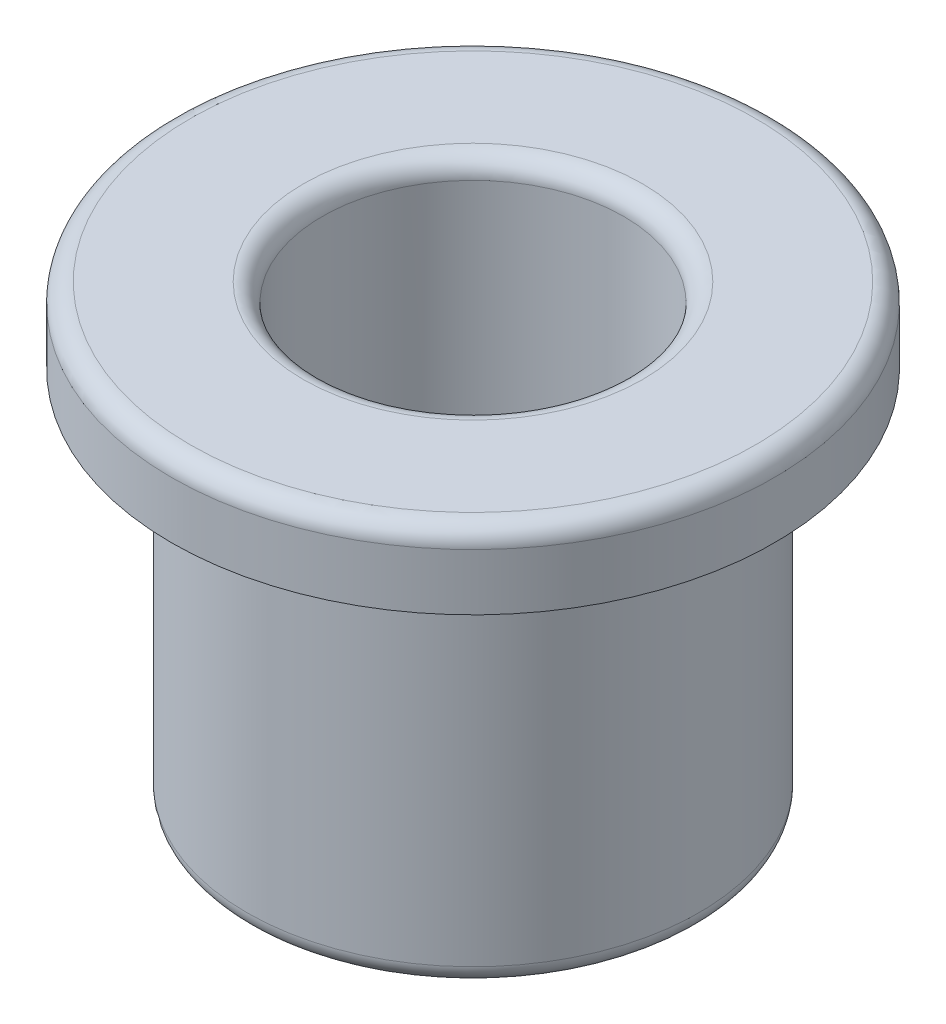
ISO-10303-21;
HEADER;
FILE_DESCRIPTION(('STEP AP214'),'2;1');
FILE_NAME('part.step','',(''),(''),'','','');
FILE_SCHEMA(('AUTOMOTIVE_DESIGN { 1 0 10303 214 1 1 1 1 }'));
ENDSEC;
DATA;
#1=APPLICATION_CONTEXT('core data for automotive mechanical design processes');
#2=APPLICATION_PROTOCOL_DEFINITION('international standard','automotive_design',2000,#1);
#3=PRODUCT_CONTEXT('',#1,'mechanical');
#4=PRODUCT('Part','Part','',(#3));
#5=PRODUCT_RELATED_PRODUCT_CATEGORY('part','',(#4));
#6=PRODUCT_DEFINITION_FORMATION('','',#4);
#7=PRODUCT_DEFINITION_CONTEXT('part definition',#1,'design');
#8=PRODUCT_DEFINITION('design','',#6,#7);
#9=PRODUCT_DEFINITION_SHAPE('','',#8);
#10=(LENGTH_UNIT() NAMED_UNIT(*) SI_UNIT(.MILLI.,.METRE.));
#11=(NAMED_UNIT(*) PLANE_ANGLE_UNIT() SI_UNIT($,.RADIAN.));
#12=(NAMED_UNIT(*) SI_UNIT($,.STERADIAN.) SOLID_ANGLE_UNIT());
#13=UNCERTAINTY_MEASURE_WITH_UNIT(LENGTH_MEASURE(1.E-05),#10,'distance_accuracy_value','');
#14=(GEOMETRIC_REPRESENTATION_CONTEXT(3) GLOBAL_UNCERTAINTY_ASSIGNED_CONTEXT((#13)) GLOBAL_UNIT_ASSIGNED_CONTEXT((#10,
#11,#12)) REPRESENTATION_CONTEXT('',''));
#15=CARTESIAN_POINT('',(0.,0.,0.));
#16=DIRECTION('',(0.,0.,1.));
#17=DIRECTION('',(1.,0.,0.));
#18=AXIS2_PLACEMENT_3D('',#15,#16,#17);
#19=CARTESIAN_POINT('',(0.,0.,0.));
#20=DIRECTION('',(0.,-0.999999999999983,0.));
#21=DIRECTION('',(0.,0.,-1.));
#22=AXIS2_PLACEMENT_3D('',#19,#20,#21);
#23=CYLINDRICAL_SURFACE('',#22,4.);
#24=CARTESIAN_POINT('',(-1.02695629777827E-12,11.499999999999,-2.45636844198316E-12));
#25=DIRECTION('',(0.,0.999999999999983,0.));
#26=DIRECTION('',(0.,0.,1.));
#27=AXIS2_PLACEMENT_3D('',#24,#25,#26);
#28=CIRCLE('',#27,4.);
#29=CARTESIAN_POINT('',(0.,11.499999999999,-4.00000000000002));
#30=VERTEX_POINT('',#29);
#31=EDGE_CURVE('E48',#30,#30,#28,.T.);
#32=CARTESIAN_POINT('',(0.,0.5,0.));
#33=DIRECTION('',(0.,-0.999999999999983,0.));
#34=DIRECTION('',(0.,0.,-1.));
#35=AXIS2_PLACEMENT_3D('',#32,#33,#34);
#36=CIRCLE('',#35,4.);
#37=CARTESIAN_POINT('',(0.,0.500000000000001,-4.00000000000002));
#38=VERTEX_POINT('',#37);
#39=EDGE_CURVE('E51',#38,#38,#36,.T.);
#40=CARTESIAN_POINT('',(0.,11.499999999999,-4.00000000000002));
#41=CARTESIAN_POINT('',(0.,11.3854166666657,-4.00000000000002));
#42=CARTESIAN_POINT('',(0.,11.2708333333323,-4.00000000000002));
#43=CARTESIAN_POINT('',(0.,11.0416666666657,-4.00000000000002));
#44=CARTESIAN_POINT('',(0.,10.9270833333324,-4.00000000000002));
#45=CARTESIAN_POINT('',(0.,10.6979166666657,-4.00000000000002));
#46=CARTESIAN_POINT('',(0.,10.5833333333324,-4.00000000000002));
#47=CARTESIAN_POINT('',(0.,10.3541666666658,-4.00000000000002));
#48=CARTESIAN_POINT('',(0.,10.2395833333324,-4.00000000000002));
#49=CARTESIAN_POINT('',(0.,10.0104166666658,-4.00000000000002));
#50=CARTESIAN_POINT('',(0.,9.89583333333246,-4.00000000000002));
#51=CARTESIAN_POINT('',(0.,9.66666666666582,-4.00000000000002));
#52=CARTESIAN_POINT('',(0.,9.55208333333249,-4.00000000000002));
#53=CARTESIAN_POINT('',(0.,9.32291666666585,-4.00000000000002));
#54=CARTESIAN_POINT('',(0.,9.20833333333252,-4.00000000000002));
#55=CARTESIAN_POINT('',(0.,8.97916666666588,-4.00000000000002));
#56=CARTESIAN_POINT('',(0.,8.86458333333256,-4.00000000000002));
#57=CARTESIAN_POINT('',(0.,8.63541666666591,-4.00000000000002));
#58=CARTESIAN_POINT('',(0.,8.52083333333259,-4.00000000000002));
#59=CARTESIAN_POINT('',(0.,8.29166666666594,-4.00000000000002));
#60=CARTESIAN_POINT('',(0.,8.17708333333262,-4.00000000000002));
#61=CARTESIAN_POINT('',(0.,7.94791666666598,-4.00000000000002));
#62=CARTESIAN_POINT('',(0.,7.83333333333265,-4.00000000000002));
#63=CARTESIAN_POINT('',(0.,7.60416666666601,-4.00000000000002));
#64=CARTESIAN_POINT('',(0.,7.48958333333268,-4.00000000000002));
#65=CARTESIAN_POINT('',(0.,7.26041666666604,-4.00000000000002));
#66=CARTESIAN_POINT('',(0.,7.14583333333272,-4.00000000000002));
#67=CARTESIAN_POINT('',(0.,6.91666666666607,-4.00000000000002));
#68=CARTESIAN_POINT('',(0.,6.80208333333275,-4.00000000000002));
#69=CARTESIAN_POINT('',(0.,6.5729166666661,-4.00000000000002));
#70=CARTESIAN_POINT('',(0.,6.45833333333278,-4.00000000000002));
#71=CARTESIAN_POINT('',(0.,6.22916666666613,-4.00000000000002));
#72=CARTESIAN_POINT('',(0.,6.11458333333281,-4.00000000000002));
#73=CARTESIAN_POINT('',(0.,5.88541666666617,-4.00000000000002));
#74=CARTESIAN_POINT('',(0.,5.77083333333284,-4.00000000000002));
#75=CARTESIAN_POINT('',(0.,5.5416666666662,-4.00000000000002));
#76=CARTESIAN_POINT('',(0.,5.42708333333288,-4.00000000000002));
#77=CARTESIAN_POINT('',(0.,5.19791666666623,-4.00000000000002));
#78=CARTESIAN_POINT('',(0.,5.08333333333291,-4.00000000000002));
#79=CARTESIAN_POINT('',(0.,4.85416666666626,-4.00000000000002));
#80=CARTESIAN_POINT('',(0.,4.73958333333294,-4.00000000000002));
#81=CARTESIAN_POINT('',(0.,4.51041666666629,-4.00000000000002));
#82=CARTESIAN_POINT('',(0.,4.39583333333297,-4.00000000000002));
#83=CARTESIAN_POINT('',(0.,4.16666666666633,-4.00000000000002));
#84=CARTESIAN_POINT('',(0.,4.052083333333,-4.00000000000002));
#85=CARTESIAN_POINT('',(0.,3.82291666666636,-4.00000000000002));
#86=CARTESIAN_POINT('',(0.,3.70833333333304,-4.00000000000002));
#87=CARTESIAN_POINT('',(0.,3.47916666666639,-4.00000000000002));
#88=CARTESIAN_POINT('',(0.,3.36458333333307,-4.00000000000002));
#89=CARTESIAN_POINT('',(0.,3.13541666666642,-4.00000000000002));
#90=CARTESIAN_POINT('',(0.,3.0208333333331,-4.00000000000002));
#91=CARTESIAN_POINT('',(0.,2.79166666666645,-4.00000000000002));
#92=CARTESIAN_POINT('',(0.,2.67708333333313,-4.00000000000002));
#93=CARTESIAN_POINT('',(0.,2.44791666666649,-4.00000000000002));
#94=CARTESIAN_POINT('',(0.,2.33333333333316,-4.00000000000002));
#95=CARTESIAN_POINT('',(0.,2.10416666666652,-4.00000000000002));
#96=CARTESIAN_POINT('',(0.,1.9895833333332,-4.00000000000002));
#97=CARTESIAN_POINT('',(0.,1.76041666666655,-4.00000000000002));
#98=CARTESIAN_POINT('',(0.,1.64583333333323,-4.00000000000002));
#99=CARTESIAN_POINT('',(0.,1.41666666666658,-4.00000000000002));
#100=CARTESIAN_POINT('',(0.,1.30208333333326,-4.00000000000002));
#101=CARTESIAN_POINT('',(0.,1.07291666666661,-4.00000000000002));
#102=CARTESIAN_POINT('',(0.,0.958333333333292,-4.00000000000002));
#103=CARTESIAN_POINT('',(0.,0.729166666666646,-4.00000000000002));
#104=CARTESIAN_POINT('',(0.,0.614583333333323,-4.00000000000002));
#105=CARTESIAN_POINT('',(0.,0.500000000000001,-4.00000000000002));
#106=B_SPLINE_CURVE_WITH_KNOTS('',3,(#40,#41,#42,#43,#44,#45,#46,#47,#48,#49,#50,#51,#52,#53,
#54,#55,#56,#57,#58,#59,#60,#61,#62,#63,#64,#65,#66,#67,#68,#69,#70,#71,#72,#73,#74,#75,#76,#77,
#78,#79,#80,#81,#82,#83,#84,#85,#86,#87,#88,#89,#90,#91,#92,#93,#94,#95,#96,#97,#98,#99,#100,
#101,#102,#103,#104,#105),.UNSPECIFIED.,.F.,.F.,(4,2,2,2,2,2,2,2,2,2,2,2,2,2,2,2,2,2,2,2,2,2,2,
2,2,2,2,2,2,2,2,2,4),(0.,0.343749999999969,0.687499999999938,1.0312499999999,1.37499999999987,
1.71874999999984,2.06249999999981,2.40624999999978,2.74999999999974,3.09374999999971,
3.43749999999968,3.78124999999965,4.12499999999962,4.46874999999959,4.81249999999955,
5.15624999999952,5.49999999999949,5.84374999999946,6.18749999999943,6.53124999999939,
6.87499999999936,7.21874999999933,7.5624999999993,7.90624999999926,8.24999999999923,
8.5937499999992,8.93749999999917,9.28124999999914,9.62499999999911,9.96874999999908,
10.312499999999,10.656249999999,10.999999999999),.UNSPECIFIED.);
#107=EDGE_CURVE('BSEAM26',#30,#38,#106,.T.);
#108=ORIENTED_EDGE('',*,*,#31,.T.);
#109=ORIENTED_EDGE('',*,*,#39,.T.);
#110=ORIENTED_EDGE('',*,*,#107,.T.);
#111=ORIENTED_EDGE('',*,*,#107,.F.);
#112=EDGE_LOOP('',(#108,#110,#109,#111));
#113=FACE_BOUND('',#112,.T.);
#114=ADVANCED_FACE('F26',(#113),#23,.F.);
#115=CARTESIAN_POINT('',(3.99999999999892,11.9999999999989,-2.67841304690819E-12));
#116=DIRECTION('',(0.,0.999999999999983,0.));
#117=DIRECTION('',(0.,0.,1.));
#118=AXIS2_PLACEMENT_3D('',#115,#116,#117);
#119=PLANE('',#118);
#120=CARTESIAN_POINT('',(-1.04083408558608E-12,11.999999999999,-2.48412401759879E-12));
#121=DIRECTION('',(0.,0.999999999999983,0.));
#122=DIRECTION('',(0.,0.,1.));
#123=AXIS2_PLACEMENT_3D('',#120,#121,#122);
#124=CIRCLE('',#123,7.5);
#125=CARTESIAN_POINT('',(-1.04374842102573E-12,11.999999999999,7.49999999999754));
#126=VERTEX_POINT('',#125);
#127=EDGE_CURVE('E54',#126,#126,#124,.T.);
#128=ORIENTED_EDGE('',*,*,#127,.T.);
#129=EDGE_LOOP('',(#128));
#130=FACE_BOUND('',#129,.T.);
#131=CARTESIAN_POINT('',(-1.04083408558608E-12,11.999999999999,-2.48412401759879E-12));
#132=DIRECTION('',(0.,0.999999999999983,0.));
#133=DIRECTION('',(0.,0.,1.));
#134=AXIS2_PLACEMENT_3D('',#131,#132,#133);
#135=CIRCLE('',#134,4.5);
#136=CARTESIAN_POINT('',(-1.04258268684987E-12,11.999999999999,4.49999999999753));
#137=VERTEX_POINT('',#136);
#138=EDGE_CURVE('E57',#137,#137,#135,.F.);
#139=ORIENTED_EDGE('',*,*,#138,.T.);
#140=EDGE_LOOP('',(#139));
#141=FACE_BOUND('',#140,.T.);
#142=ADVANCED_FACE('F71',(#130,#141),#119,.T.);
#143=CARTESIAN_POINT('',(0.,0.,0.));
#144=DIRECTION('',(0.,-0.999999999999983,0.));
#145=DIRECTION('',(0.,0.,-1.));
#146=AXIS2_PLACEMENT_3D('',#143,#144,#145);
#147=CYLINDRICAL_SURFACE('',#146,8.);
#148=CARTESIAN_POINT('',(-1.02695629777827E-12,11.499999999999,-2.45636844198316E-12));
#149=DIRECTION('',(0.,0.999999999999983,0.));
#150=DIRECTION('',(0.,0.,1.));
#151=AXIS2_PLACEMENT_3D('',#148,#149,#150);
#152=CIRCLE('',#151,8.);
#153=CARTESIAN_POINT('',(0.,11.499999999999,-8.00000000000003));
#154=VERTEX_POINT('',#153);
#155=EDGE_CURVE('E60',#154,#154,#152,.F.);
#156=CARTESIAN_POINT('',(-1.80411241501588E-13,9.99999999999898,-4.44089209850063E-13));
#157=DIRECTION('',(0.,-0.999999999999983,0.));
#158=DIRECTION('',(0.,0.,-1.));
#159=AXIS2_PLACEMENT_3D('',#156,#157,#158);
#160=CIRCLE('',#159,8.);
#161=CARTESIAN_POINT('',(0.,9.99999999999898,-8.00000000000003));
#162=VERTEX_POINT('',#161);
#163=EDGE_CURVE('E63',#162,#162,#160,.T.);
#164=CARTESIAN_POINT('',(0.,11.499999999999,-8.00000000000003));
#165=CARTESIAN_POINT('',(0.,11.484374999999,-8.00000000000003));
#166=CARTESIAN_POINT('',(0.,11.468749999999,-8.00000000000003));
#167=CARTESIAN_POINT('',(0.,11.437499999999,-8.00000000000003));
#168=CARTESIAN_POINT('',(0.,11.421874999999,-8.00000000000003));
#169=CARTESIAN_POINT('',(0.,11.390624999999,-8.00000000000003));
#170=CARTESIAN_POINT('',(0.,11.374999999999,-8.00000000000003));
#171=CARTESIAN_POINT('',(0.,11.343749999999,-8.00000000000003));
#172=CARTESIAN_POINT('',(0.,11.328124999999,-8.00000000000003));
#173=CARTESIAN_POINT('',(0.,11.296874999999,-8.00000000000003));
#174=CARTESIAN_POINT('',(0.,11.281249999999,-8.00000000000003));
#175=CARTESIAN_POINT('',(0.,11.249999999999,-8.00000000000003));
#176=CARTESIAN_POINT('',(0.,11.234374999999,-8.00000000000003));
#177=CARTESIAN_POINT('',(0.,11.203124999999,-8.00000000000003));
#178=CARTESIAN_POINT('',(0.,11.187499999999,-8.00000000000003));
#179=CARTESIAN_POINT('',(0.,11.156249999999,-8.00000000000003));
#180=CARTESIAN_POINT('',(0.,11.140624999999,-8.00000000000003));
#181=CARTESIAN_POINT('',(0.,11.109374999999,-8.00000000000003));
#182=CARTESIAN_POINT('',(0.,11.093749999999,-8.00000000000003));
#183=CARTESIAN_POINT('',(0.,11.062499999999,-8.00000000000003));
#184=CARTESIAN_POINT('',(0.,11.046874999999,-8.00000000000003));
#185=CARTESIAN_POINT('',(0.,11.015624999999,-8.00000000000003));
#186=CARTESIAN_POINT('',(0.,10.999999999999,-8.00000000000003));
#187=CARTESIAN_POINT('',(0.,10.968749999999,-8.00000000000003));
#188=CARTESIAN_POINT('',(0.,10.953124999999,-8.00000000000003));
#189=CARTESIAN_POINT('',(0.,10.921874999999,-8.00000000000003));
#190=CARTESIAN_POINT('',(0.,10.906249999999,-8.00000000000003));
#191=CARTESIAN_POINT('',(0.,10.874999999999,-8.00000000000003));
#192=CARTESIAN_POINT('',(0.,10.859374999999,-8.00000000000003));
#193=CARTESIAN_POINT('',(0.,10.828124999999,-8.00000000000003));
#194=CARTESIAN_POINT('',(0.,10.812499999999,-8.00000000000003));
#195=CARTESIAN_POINT('',(0.,10.781249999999,-8.00000000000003));
#196=CARTESIAN_POINT('',(0.,10.765624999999,-8.00000000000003));
#197=CARTESIAN_POINT('',(0.,10.734374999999,-8.00000000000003));
#198=CARTESIAN_POINT('',(0.,10.718749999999,-8.00000000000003));
#199=CARTESIAN_POINT('',(0.,10.687499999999,-8.00000000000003));
#200=CARTESIAN_POINT('',(0.,10.671874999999,-8.00000000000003));
#201=CARTESIAN_POINT('',(0.,10.640624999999,-8.00000000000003));
#202=CARTESIAN_POINT('',(0.,10.624999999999,-8.00000000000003));
#203=CARTESIAN_POINT('',(0.,10.593749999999,-8.00000000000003));
#204=CARTESIAN_POINT('',(0.,10.578124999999,-8.00000000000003));
#205=CARTESIAN_POINT('',(0.,10.546874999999,-8.00000000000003));
#206=CARTESIAN_POINT('',(0.,10.531249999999,-8.00000000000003));
#207=CARTESIAN_POINT('',(0.,10.499999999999,-8.00000000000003));
#208=CARTESIAN_POINT('',(0.,10.484374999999,-8.00000000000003));
#209=CARTESIAN_POINT('',(0.,10.453124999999,-8.00000000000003));
#210=CARTESIAN_POINT('',(0.,10.437499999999,-8.00000000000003));
#211=CARTESIAN_POINT('',(0.,10.406249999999,-8.00000000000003));
#212=CARTESIAN_POINT('',(0.,10.390624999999,-8.00000000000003));
#213=CARTESIAN_POINT('',(0.,10.359374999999,-8.00000000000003));
#214=CARTESIAN_POINT('',(0.,10.343749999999,-8.00000000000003));
#215=CARTESIAN_POINT('',(0.,10.312499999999,-8.00000000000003));
#216=CARTESIAN_POINT('',(0.,10.296874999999,-8.00000000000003));
#217=CARTESIAN_POINT('',(0.,10.265624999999,-8.00000000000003));
#218=CARTESIAN_POINT('',(0.,10.249999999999,-8.00000000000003));
#219=CARTESIAN_POINT('',(0.,10.218749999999,-8.00000000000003));
#220=CARTESIAN_POINT('',(0.,10.203124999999,-8.00000000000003));
#221=CARTESIAN_POINT('',(0.,10.171874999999,-8.00000000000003));
#222=CARTESIAN_POINT('',(0.,10.156249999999,-8.00000000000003));
#223=CARTESIAN_POINT('',(0.,10.124999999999,-8.00000000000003));
#224=CARTESIAN_POINT('',(0.,10.109374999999,-8.00000000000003));
#225=CARTESIAN_POINT('',(0.,10.078124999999,-8.00000000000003));
#226=CARTESIAN_POINT('',(0.,10.062499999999,-8.00000000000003));
#227=CARTESIAN_POINT('',(0.,10.031249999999,-8.00000000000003));
#228=CARTESIAN_POINT('',(0.,10.015624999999,-8.00000000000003));
#229=CARTESIAN_POINT('',(0.,9.99999999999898,-8.00000000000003));
#230=B_SPLINE_CURVE_WITH_KNOTS('',3,(#164,#165,#166,#167,#168,#169,#170,#171,#172,#173,#174,
#175,#176,#177,#178,#179,#180,#181,#182,#183,#184,#185,#186,#187,#188,#189,#190,#191,#192,#193,
#194,#195,#196,#197,#198,#199,#200,#201,#202,#203,#204,#205,#206,#207,#208,#209,#210,#211,#212,
#213,#214,#215,#216,#217,#218,#219,#220,#221,#222,#223,#224,#225,#226,#227,#228,#229),
.UNSPECIFIED.,.F.,.F.,(4,2,2,2,2,2,2,2,2,2,2,2,2,2,2,2,2,2,2,2,2,2,2,2,2,2,2,2,2,2,2,2,4),(0.,
0.046875,0.0937500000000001,0.140625,0.187499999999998,0.234375,0.28125,0.328124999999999,
0.374999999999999,0.421874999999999,0.468749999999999,0.515624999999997,0.562499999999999,
0.609374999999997,0.656249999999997,0.703124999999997,0.749999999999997,0.796874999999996,
0.843749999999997,0.890624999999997,0.937499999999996,0.984374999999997,1.03125,1.078125,1.125,
1.171875,1.21874999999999,1.265625,1.31249999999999,1.35937499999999,1.40624999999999,
1.45312499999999,1.49999999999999),.UNSPECIFIED.);
#231=EDGE_CURVE('BSEAM69',#154,#162,#230,.T.);
#232=ORIENTED_EDGE('',*,*,#155,.T.);
#233=ORIENTED_EDGE('',*,*,#163,.F.);
#234=ORIENTED_EDGE('',*,*,#231,.T.);
#235=ORIENTED_EDGE('',*,*,#231,.F.);
#236=EDGE_LOOP('',(#232,#234,#233,#235));
#237=FACE_BOUND('',#236,.T.);
#238=ADVANCED_FACE('F69',(#237),#147,.T.);
#239=CARTESIAN_POINT('',(5.99999999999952,9.99999999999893,-1.20736753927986E-12));
#240=DIRECTION('',(0.,-0.999999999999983,0.));
#241=DIRECTION('',(0.,0.,-1.));
#242=AXIS2_PLACEMENT_3D('',#239,#240,#241);
#243=PLANE('',#242);
#244=CARTESIAN_POINT('',(-1.80411241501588E-13,9.99999999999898,-4.44089209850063E-13));
#245=DIRECTION('',(0.,-0.999999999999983,0.));
#246=DIRECTION('',(0.,0.,-1.));
#247=AXIS2_PLACEMENT_3D('',#244,#245,#246);
#248=CIRCLE('',#247,6.5);
#249=CARTESIAN_POINT('',(-1.77885484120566E-13,9.99999999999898,-6.50000000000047));
#250=VERTEX_POINT('',#249);
#251=EDGE_CURVE('E10',#250,#250,#248,.F.);
#252=ORIENTED_EDGE('',*,*,#251,.T.);
#253=EDGE_LOOP('',(#252));
#254=FACE_BOUND('',#253,.T.);
#255=ORIENTED_EDGE('',*,*,#163,.T.);
#256=EDGE_LOOP('',(#255));
#257=FACE_BOUND('',#256,.T.);
#258=ADVANCED_FACE('F67',(#254,#257),#243,.T.);
#259=CARTESIAN_POINT('',(0.,0.,0.));
#260=DIRECTION('',(0.,-0.999999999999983,0.));
#261=DIRECTION('',(0.,0.,-1.));
#262=AXIS2_PLACEMENT_3D('',#259,#260,#261);
#263=CYLINDRICAL_SURFACE('',#262,6.);
#264=CARTESIAN_POINT('',(0.,0.5,0.));
#265=DIRECTION('',(0.,-0.999999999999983,0.));
#266=DIRECTION('',(0.,0.,-1.));
#267=AXIS2_PLACEMENT_3D('',#264,#265,#266);
#268=CIRCLE('',#267,6.);
#269=CARTESIAN_POINT('',(0.,0.500000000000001,-6.00000000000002));
#270=VERTEX_POINT('',#269);
#271=EDGE_CURVE('E32',#270,#270,#268,.F.);
#272=CARTESIAN_POINT('',(-1.80411241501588E-13,9.49999999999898,-4.44089209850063E-13));
#273=DIRECTION('',(0.,-0.999999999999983,0.));
#274=DIRECTION('',(0.,0.,-1.));
#275=AXIS2_PLACEMENT_3D('',#272,#273,#274);
#276=CIRCLE('',#275,6.);
#277=CARTESIAN_POINT('',(0.,9.49999999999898,-6.00000000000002));
#278=VERTEX_POINT('',#277);
#279=EDGE_CURVE('E36',#278,#278,#276,.T.);
#280=CARTESIAN_POINT('',(0.,0.500000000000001,-6.00000000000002));
#281=CARTESIAN_POINT('',(0.,0.59374999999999,-6.00000000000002));
#282=CARTESIAN_POINT('',(0.,0.687499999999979,-6.00000000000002));
#283=CARTESIAN_POINT('',(0.,0.874999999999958,-6.00000000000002));
#284=CARTESIAN_POINT('',(0.,0.968749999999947,-6.00000000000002));
#285=CARTESIAN_POINT('',(0.,1.15624999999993,-6.00000000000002));
#286=CARTESIAN_POINT('',(0.,1.24999999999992,-6.00000000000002));
#287=CARTESIAN_POINT('',(0.,1.43749999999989,-6.00000000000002));
#288=CARTESIAN_POINT('',(0.,1.53124999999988,-6.00000000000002));
#289=CARTESIAN_POINT('',(0.,1.71874999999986,-6.00000000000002));
#290=CARTESIAN_POINT('',(0.,1.81249999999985,-6.00000000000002));
#291=CARTESIAN_POINT('',(0.,1.99999999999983,-6.00000000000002));
#292=CARTESIAN_POINT('',(0.,2.09374999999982,-6.00000000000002));
#293=CARTESIAN_POINT('',(0.,2.2812499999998,-6.00000000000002));
#294=CARTESIAN_POINT('',(0.,2.37499999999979,-6.00000000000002));
#295=CARTESIAN_POINT('',(0.,2.56249999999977,-6.00000000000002));
#296=CARTESIAN_POINT('',(0.,2.65624999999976,-6.00000000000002));
#297=CARTESIAN_POINT('',(0.,2.84374999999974,-6.00000000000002));
#298=CARTESIAN_POINT('',(0.,2.93749999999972,-6.00000000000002));
#299=CARTESIAN_POINT('',(0.,3.1249999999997,-6.00000000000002));
#300=CARTESIAN_POINT('',(0.,3.21874999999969,-6.00000000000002));
#301=CARTESIAN_POINT('',(0.,3.40624999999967,-6.00000000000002));
#302=CARTESIAN_POINT('',(0.,3.49999999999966,-6.00000000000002));
#303=CARTESIAN_POINT('',(0.,3.68749999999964,-6.00000000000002));
#304=CARTESIAN_POINT('',(0.,3.78124999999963,-6.00000000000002));
#305=CARTESIAN_POINT('',(0.,3.96874999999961,-6.00000000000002));
#306=CARTESIAN_POINT('',(0.,4.0624999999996,-6.00000000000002));
#307=CARTESIAN_POINT('',(0.,4.24999999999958,-6.00000000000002));
#308=CARTESIAN_POINT('',(0.,4.34374999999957,-6.00000000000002));
#309=CARTESIAN_POINT('',(0.,4.53124999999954,-6.00000000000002));
#310=CARTESIAN_POINT('',(0.,4.62499999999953,-6.00000000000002));
#311=CARTESIAN_POINT('',(0.,4.81249999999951,-6.00000000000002));
#312=CARTESIAN_POINT('',(0.,4.9062499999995,-6.00000000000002));
#313=CARTESIAN_POINT('',(0.,5.09374999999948,-6.00000000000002));
#314=CARTESIAN_POINT('',(0.,5.18749999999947,-6.00000000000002));
#315=CARTESIAN_POINT('',(0.,5.37499999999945,-6.00000000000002));
#316=CARTESIAN_POINT('',(0.,5.46874999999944,-6.00000000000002));
#317=CARTESIAN_POINT('',(0.,5.65624999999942,-6.00000000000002));
#318=CARTESIAN_POINT('',(0.,5.74999999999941,-6.00000000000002));
#319=CARTESIAN_POINT('',(0.,5.93749999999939,-6.00000000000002));
#320=CARTESIAN_POINT('',(0.,6.03124999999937,-6.00000000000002));
#321=CARTESIAN_POINT('',(0.,6.21874999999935,-6.00000000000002));
#322=CARTESIAN_POINT('',(0.,6.31249999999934,-6.00000000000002));
#323=CARTESIAN_POINT('',(0.,6.49999999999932,-6.00000000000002));
#324=CARTESIAN_POINT('',(0.,6.59374999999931,-6.00000000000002));
#325=CARTESIAN_POINT('',(0.,6.78124999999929,-6.00000000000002));
#326=CARTESIAN_POINT('',(0.,6.87499999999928,-6.00000000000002));
#327=CARTESIAN_POINT('',(0.,7.06249999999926,-6.00000000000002));
#328=CARTESIAN_POINT('',(0.,7.15624999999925,-6.00000000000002));
#329=CARTESIAN_POINT('',(0.,7.34374999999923,-6.00000000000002));
#330=CARTESIAN_POINT('',(0.,7.43749999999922,-6.00000000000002));
#331=CARTESIAN_POINT('',(0.,7.6249999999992,-6.00000000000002));
#332=CARTESIAN_POINT('',(0.,7.71874999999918,-6.00000000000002));
#333=CARTESIAN_POINT('',(0.,7.90624999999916,-6.00000000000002));
#334=CARTESIAN_POINT('',(0.,7.99999999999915,-6.00000000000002));
#335=CARTESIAN_POINT('',(0.,8.18749999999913,-6.00000000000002));
#336=CARTESIAN_POINT('',(0.,8.28124999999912,-6.00000000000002));
#337=CARTESIAN_POINT('',(0.,8.4687499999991,-6.00000000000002));
#338=CARTESIAN_POINT('',(0.,8.56249999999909,-6.00000000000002));
#339=CARTESIAN_POINT('',(0.,8.74999999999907,-6.00000000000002));
#340=CARTESIAN_POINT('',(0.,8.84374999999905,-6.00000000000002));
#341=CARTESIAN_POINT('',(0.,9.03124999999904,-6.00000000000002));
#342=CARTESIAN_POINT('',(0.,9.12499999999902,-6.00000000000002));
#343=CARTESIAN_POINT('',(0.,9.312499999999,-6.00000000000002));
#344=CARTESIAN_POINT('',(0.,9.40624999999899,-6.00000000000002));
#345=CARTESIAN_POINT('',(0.,9.49999999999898,-6.00000000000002));
#346=B_SPLINE_CURVE_WITH_KNOTS('',3,(#280,#281,#282,#283,#284,#285,#286,#287,#288,#289,#290,
#291,#292,#293,#294,#295,#296,#297,#298,#299,#300,#301,#302,#303,#304,#305,#306,#307,#308,#309,
#310,#311,#312,#313,#314,#315,#316,#317,#318,#319,#320,#321,#322,#323,#324,#325,#326,#327,#328,
#329,#330,#331,#332,#333,#334,#335,#336,#337,#338,#339,#340,#341,#342,#343,#344,#345),
.UNSPECIFIED.,.F.,.F.,(4,2,2,2,2,2,2,2,2,2,2,2,2,2,2,2,2,2,2,2,2,2,2,2,2,2,2,2,2,2,2,2,4),(0.,
0.281249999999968,0.562499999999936,0.843749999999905,1.12499999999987,1.40624999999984,
1.68749999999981,1.96874999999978,2.24999999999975,2.53124999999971,2.81249999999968,
3.09374999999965,3.37499999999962,3.65624999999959,3.93749999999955,4.21874999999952,
4.49999999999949,4.78124999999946,5.06249999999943,5.3437499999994,5.62499999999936,
5.90624999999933,6.1874999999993,6.46874999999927,6.74999999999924,7.0312499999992,
7.31249999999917,7.59374999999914,7.87499999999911,8.15624999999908,8.43749999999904,
8.71874999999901,8.99999999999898),.UNSPECIFIED.);
#347=EDGE_CURVE('BSEAM78',#270,#278,#346,.T.);
#348=ORIENTED_EDGE('',*,*,#271,.T.);
#349=ORIENTED_EDGE('',*,*,#279,.T.);
#350=ORIENTED_EDGE('',*,*,#347,.T.);
#351=ORIENTED_EDGE('',*,*,#347,.F.);
#352=EDGE_LOOP('',(#348,#350,#349,#351));
#353=FACE_BOUND('',#352,.T.);
#354=ADVANCED_FACE('F78',(#353),#263,.T.);
#355=CARTESIAN_POINT('',(4.,0.,0.));
#356=DIRECTION('',(0.,-0.999999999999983,0.));
#357=DIRECTION('',(0.,0.,-1.));
#358=AXIS2_PLACEMENT_3D('',#355,#356,#357);
#359=PLANE('',#358);
#360=CARTESIAN_POINT('',(0.,0.,0.));
#361=DIRECTION('',(0.,-0.999999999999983,0.));
#362=DIRECTION('',(0.,0.,-1.));
#363=AXIS2_PLACEMENT_3D('',#360,#361,#362);
#364=CIRCLE('',#363,4.5);
#365=CARTESIAN_POINT('',(0.,0.,-4.50000000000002));
#366=VERTEX_POINT('',#365);
#367=EDGE_CURVE('E40',#366,#366,#364,.F.);
#368=ORIENTED_EDGE('',*,*,#367,.T.);
#369=EDGE_LOOP('',(#368));
#370=FACE_BOUND('',#369,.T.);
#371=CARTESIAN_POINT('',(0.,0.,0.));
#372=DIRECTION('',(0.,-0.999999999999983,0.));
#373=DIRECTION('',(0.,0.,-1.));
#374=AXIS2_PLACEMENT_3D('',#371,#372,#373);
#375=CIRCLE('',#374,5.5);
#376=CARTESIAN_POINT('',(0.,0.,-5.50000000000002));
#377=VERTEX_POINT('',#376);
#378=EDGE_CURVE('E45',#377,#377,#375,.T.);
#379=ORIENTED_EDGE('',*,*,#378,.T.);
#380=EDGE_LOOP('',(#379));
#381=FACE_BOUND('',#380,.T.);
#382=ADVANCED_FACE('F110',(#370,#381),#359,.T.);
#383=CARTESIAN_POINT('',(-1.02695629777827E-12,11.499999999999,-2.45636844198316E-12));
#384=DIRECTION('',(0.,0.999999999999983,0.));
#385=DIRECTION('',(0.,0.,1.));
#386=AXIS2_PLACEMENT_3D('',#383,#384,#385);
#387=TOROIDAL_SURFACE('',#386,7.5,0.5);
#388=ORIENTED_EDGE('',*,*,#127,.F.);
#389=EDGE_LOOP('',(#388));
#390=FACE_BOUND('',#389,.T.);
#391=ORIENTED_EDGE('',*,*,#155,.F.);
#392=EDGE_LOOP('',(#391));
#393=FACE_BOUND('',#392,.T.);
#394=ADVANCED_FACE('F102',(#390,#393),#387,.T.);
#395=CARTESIAN_POINT('',(-1.02695629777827E-12,11.499999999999,-2.45636844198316E-12));
#396=DIRECTION('',(0.,0.999999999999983,0.));
#397=DIRECTION('',(0.,0.,1.));
#398=AXIS2_PLACEMENT_3D('',#395,#396,#397);
#399=TOROIDAL_SURFACE('',#398,4.5,0.5);
#400=ORIENTED_EDGE('',*,*,#31,.F.);
#401=EDGE_LOOP('',(#400));
#402=FACE_BOUND('',#401,.T.);
#403=ORIENTED_EDGE('',*,*,#138,.F.);
#404=EDGE_LOOP('',(#403));
#405=FACE_BOUND('',#404,.T.);
#406=ADVANCED_FACE('F92',(#402,#405),#399,.T.);
#407=CARTESIAN_POINT('',(0.,0.5,0.));
#408=DIRECTION('',(0.,-0.999999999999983,0.));
#409=DIRECTION('',(0.,0.,-1.));
#410=AXIS2_PLACEMENT_3D('',#407,#408,#409);
#411=TOROIDAL_SURFACE('',#410,4.5,0.5);
#412=ORIENTED_EDGE('',*,*,#367,.F.);
#413=EDGE_LOOP('',(#412));
#414=FACE_BOUND('',#413,.T.);
#415=ORIENTED_EDGE('',*,*,#39,.F.);
#416=EDGE_LOOP('',(#415));
#417=FACE_BOUND('',#416,.T.);
#418=ADVANCED_FACE('F89',(#414,#417),#411,.T.);
#419=CARTESIAN_POINT('',(0.,0.5,0.));
#420=DIRECTION('',(0.,-0.999999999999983,0.));
#421=DIRECTION('',(0.,0.,-1.));
#422=AXIS2_PLACEMENT_3D('',#419,#420,#421);
#423=TOROIDAL_SURFACE('',#422,5.5,0.5);
#424=ORIENTED_EDGE('',*,*,#271,.F.);
#425=EDGE_LOOP('',(#424));
#426=FACE_BOUND('',#425,.T.);
#427=ORIENTED_EDGE('',*,*,#378,.F.);
#428=EDGE_LOOP('',(#427));
#429=FACE_BOUND('',#428,.T.);
#430=ADVANCED_FACE('F91',(#426,#429),#423,.T.);
#431=CARTESIAN_POINT('',(-1.80411241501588E-13,9.49999999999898,-4.44089209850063E-13));
#432=DIRECTION('',(0.,-0.999999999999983,0.));
#433=DIRECTION('',(0.,0.,-1.));
#434=AXIS2_PLACEMENT_3D('',#431,#432,#433);
#435=TOROIDAL_SURFACE('',#434,6.5,0.5);
#436=ORIENTED_EDGE('',*,*,#251,.F.);
#437=EDGE_LOOP('',(#436));
#438=FACE_BOUND('',#437,.T.);
#439=ORIENTED_EDGE('',*,*,#279,.F.);
#440=EDGE_LOOP('',(#439));
#441=FACE_BOUND('',#440,.T.);
#442=ADVANCED_FACE('F99',(#438,#441),#435,.F.);
#443=CLOSED_SHELL('',(#114,#142,#238,#258,#354,#382,#394,#406,#418,#430,#442));
#444=MANIFOLD_SOLID_BREP('B2',#443);
#445=ADVANCED_BREP_SHAPE_REPRESENTATION('',(#18,#444),#14);
#446=SHAPE_DEFINITION_REPRESENTATION(#9,#445);
ENDSEC;
END-ISO-10303-21;
